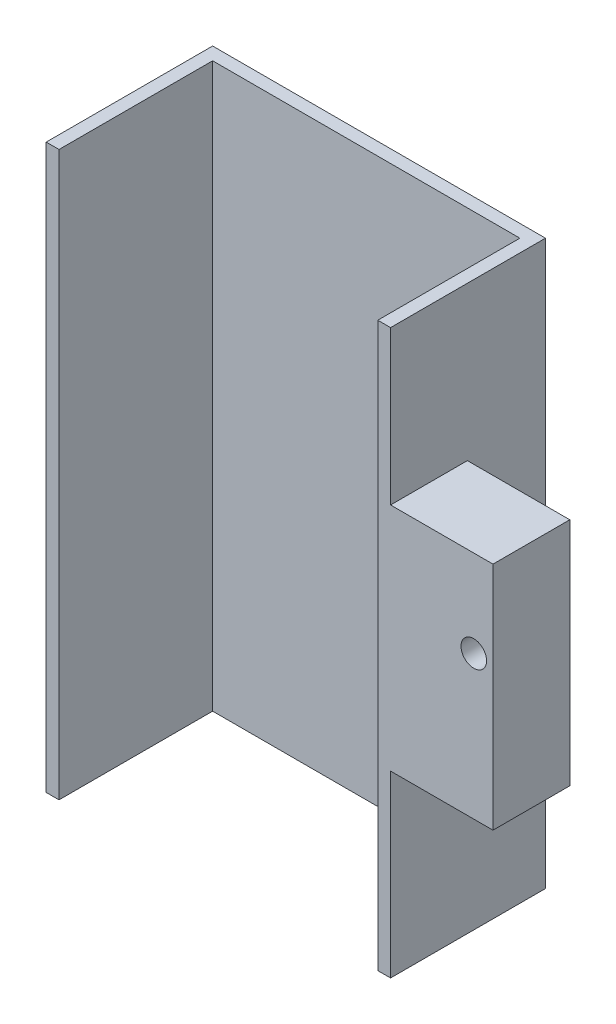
from build123d import *

# Parameters (mm, degrees)
EXTRUSION1_DEPTH        = 440
ESQUISSE2_W             = 60
ESQUISSE2_H             = 180
EXTRUSION2_DEPTH        = 80
ESQUISSE3_W             = 63.127522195
ESQUISSE3_H             = 461.662631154
ENL_V_MAT_EXTRU_1_DEPTH = 80
ESQUISSE4_R             = 10
ENL_V_MAT_EXTRU_2_DEPTH = 498.837322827


with BuildPart() as part:
    # Esquisse1 → Extrusion1 (new body)
    with BuildSketch(Plane(origin=(0, 0, 0), x_dir=(1, 0, 0), z_dir=(0, 1, 0))):
        Polygon((-189, 120), (51, 120), (51, 0), (61, 0), (61, 130), (-199, 130), (-199, 0), (-189, 0), align=None)
    extrude(amount=EXTRUSION1_DEPTH)

    # Esquisse2 → Extrusion2 (add)
    with BuildSketch(Plane(origin=(61, 0, 0), x_dir=(0, 0, -1), z_dir=(1, 0, 0))):
        with Locations((39, 230)):
            Rectangle(ESQUISSE2_W, ESQUISSE2_H)
    extrude(amount=EXTRUSION2_DEPTH)

    # Esquisse3 → Enl_v. mat.-Extru.1 (cut)
    with BuildSketch(Plane(origin=(61, 0, 0), x_dir=(0, 0, -1), z_dir=(1, 0, 0))):
        with Locations((-22.563761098, 222.959375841)):
            Rectangle(ESQUISSE3_W, ESQUISSE3_H)
    extrude(amount=-ENL_V_MAT_EXTRU_1_DEPTH, mode=Mode.SUBTRACT)

    # Esquisse4 → Enl_v. mat.-Extru.2 (cut, through all)
    with BuildSketch(Plane.XY.offset(-9)):
        with Locations((126, 252.03)):
            Circle(ESQUISSE4_R)
    extrude(amount=-ENL_V_MAT_EXTRU_2_DEPTH, mode=Mode.SUBTRACT)


solid = part.part
